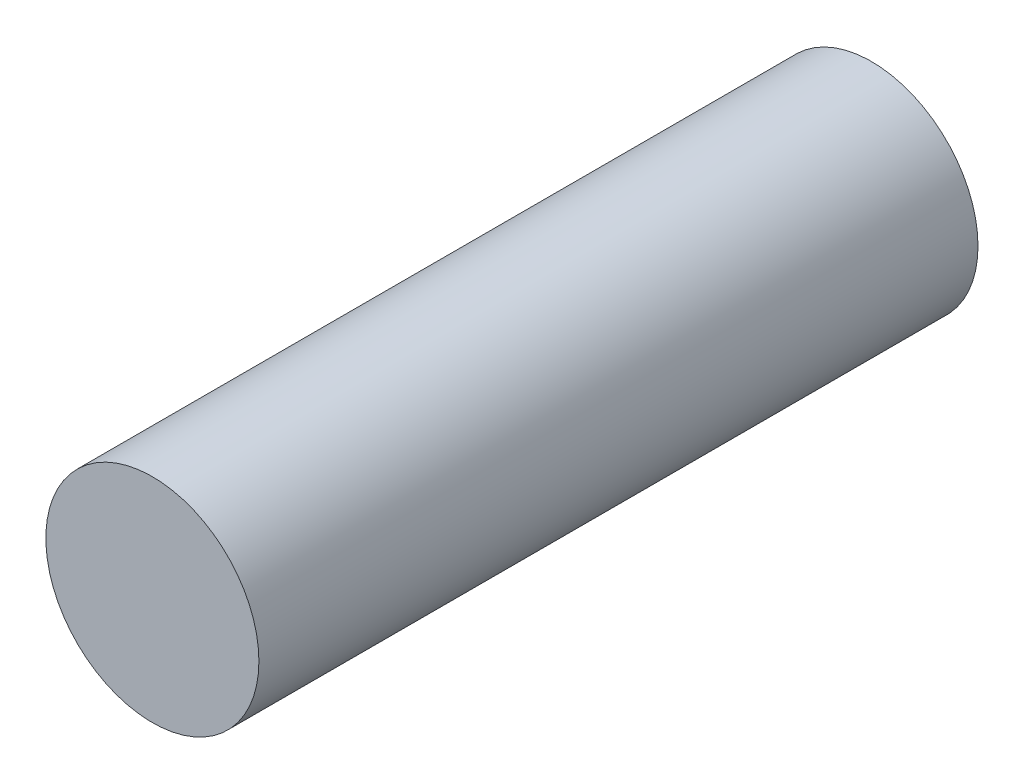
from build123d import *

# Parameters (mm, degrees)
SKETCH_1_R                    = 2
MOUNTING_SCREW_SHANK_D4_DEPTH = 6.75


with BuildPart() as part:
    # Sketch 1 → Mounting_Screw_Shank_D4 (new, symmetric)
    with BuildSketch(Plane.XY):
        Circle(SKETCH_1_R)
    extrude(amount=MOUNTING_SCREW_SHANK_D4_DEPTH, both=True)


solid = part.part
